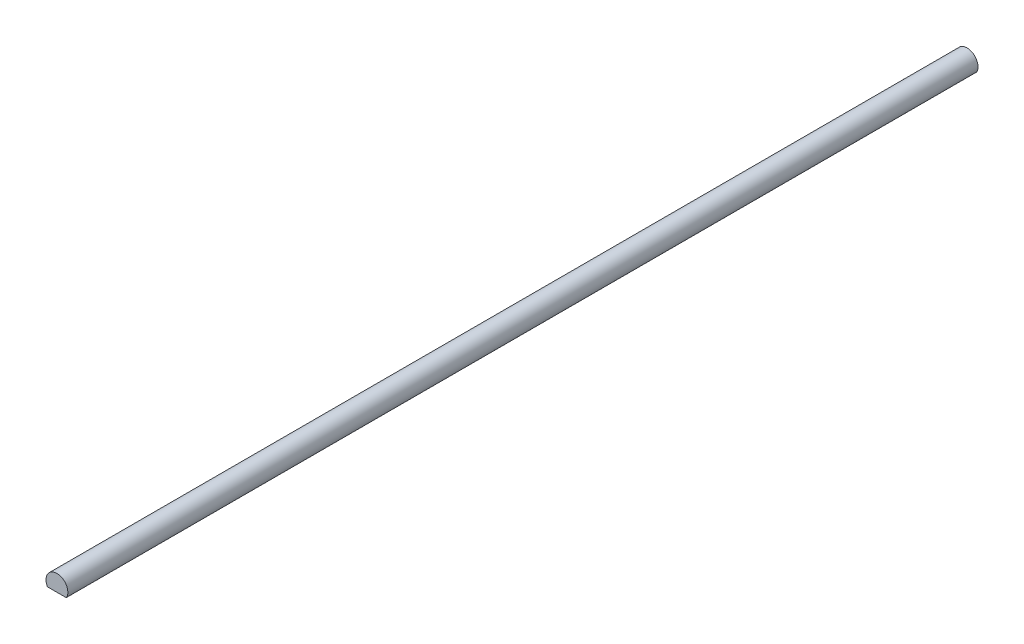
ISO-10303-21;
HEADER;
FILE_DESCRIPTION(('STEP AP214'),'2;1');
FILE_NAME('part.step','',(''),(''),'','','');
FILE_SCHEMA(('AUTOMOTIVE_DESIGN { 1 0 10303 214 1 1 1 1 }'));
ENDSEC;
DATA;
#1=APPLICATION_CONTEXT('core data for automotive mechanical design processes');
#2=APPLICATION_PROTOCOL_DEFINITION('international standard','automotive_design',2000,#1);
#3=PRODUCT_CONTEXT('',#1,'mechanical');
#4=PRODUCT('Part','Part','',(#3));
#5=PRODUCT_RELATED_PRODUCT_CATEGORY('part','',(#4));
#6=PRODUCT_DEFINITION_FORMATION('','',#4);
#7=PRODUCT_DEFINITION_CONTEXT('part definition',#1,'design');
#8=PRODUCT_DEFINITION('design','',#6,#7);
#9=PRODUCT_DEFINITION_SHAPE('','',#8);
#10=(LENGTH_UNIT() NAMED_UNIT(*) SI_UNIT(.MILLI.,.METRE.));
#11=(NAMED_UNIT(*) PLANE_ANGLE_UNIT() SI_UNIT($,.RADIAN.));
#12=(NAMED_UNIT(*) SI_UNIT($,.STERADIAN.) SOLID_ANGLE_UNIT());
#13=UNCERTAINTY_MEASURE_WITH_UNIT(LENGTH_MEASURE(1.E-05),#10,'distance_accuracy_value','');
#14=(GEOMETRIC_REPRESENTATION_CONTEXT(3) GLOBAL_UNCERTAINTY_ASSIGNED_CONTEXT((#13)) GLOBAL_UNIT_ASSIGNED_CONTEXT((#10,
#11,#12)) REPRESENTATION_CONTEXT('',''));
#15=CARTESIAN_POINT('',(0.,0.,0.));
#16=DIRECTION('',(0.,0.,1.));
#17=DIRECTION('',(1.,0.,0.));
#18=AXIS2_PLACEMENT_3D('',#15,#16,#17);
#19=CARTESIAN_POINT('',(4.8989794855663,0.5,500.));
#20=DIRECTION('',(0.,0.,-1.));
#21=DIRECTION('',(-1.,0.,0.));
#22=AXIS2_PLACEMENT_3D('',#19,#20,#21);
#23=CYLINDRICAL_SURFACE('',#22,0.500000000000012);
#24=CARTESIAN_POINT('',(4.8989794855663,0.5,0.));
#25=DIRECTION('',(0.,0.,1.));
#26=DIRECTION('',(1.,0.,0.));
#27=AXIS2_PLACEMENT_3D('',#24,#25,#26);
#28=CIRCLE('',#27,0.500000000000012);
#29=CARTESIAN_POINT('',(4.8989794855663,0.,0.));
#30=VERTEX_POINT('',#29);
#31=CARTESIAN_POINT('',(5.34434125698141,0.272727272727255,0.));
#32=VERTEX_POINT('',#31);
#33=EDGE_CURVE('E77',#30,#32,#28,.T.);
#34=ORIENTED_EDGE('',*,*,#33,.T.);
#35=DIRECTION('',(0.,0.,-1.));
#36=VECTOR('',#35,1.);
#37=CARTESIAN_POINT('',(5.34434125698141,0.272727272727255,500.));
#38=LINE('',#37,#36);
#39=CARTESIAN_POINT('',(5.34434125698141,0.272727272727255,500.));
#40=VERTEX_POINT('',#39);
#41=EDGE_CURVE('E9',#40,#32,#38,.T.);
#42=ORIENTED_EDGE('',*,*,#41,.F.);
#43=CARTESIAN_POINT('',(4.8989794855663,0.5,500.));
#44=DIRECTION('',(0.,0.,1.));
#45=DIRECTION('',(1.,0.,0.));
#46=AXIS2_PLACEMENT_3D('',#43,#44,#45);
#47=CIRCLE('',#46,0.500000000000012);
#48=CARTESIAN_POINT('',(4.8989794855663,0.,500.));
#49=VERTEX_POINT('',#48);
#50=EDGE_CURVE('E65',#49,#40,#47,.T.);
#51=ORIENTED_EDGE('',*,*,#50,.F.);
#52=DIRECTION('',(0.,0.,-1.));
#53=VECTOR('',#52,1.);
#54=CARTESIAN_POINT('',(4.8989794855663,0.,500.));
#55=LINE('',#54,#53);
#56=EDGE_CURVE('E73',#49,#30,#55,.T.);
#57=ORIENTED_EDGE('',*,*,#56,.T.);
#58=EDGE_LOOP('',(#34,#42,#51,#57));
#59=FACE_BOUND('',#58,.T.);
#60=ADVANCED_FACE('F14',(#59),#23,.T.);
#61=CARTESIAN_POINT('',(0.,3.00000000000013,500.));
#62=DIRECTION('',(0.,0.,-1.));
#63=DIRECTION('',(-1.,0.,0.));
#64=AXIS2_PLACEMENT_3D('',#61,#62,#63);
#65=CYLINDRICAL_SURFACE('',#64,6.);
#66=CARTESIAN_POINT('',(0.,3.00000000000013,0.));
#67=DIRECTION('',(0.,0.,1.));
#68=DIRECTION('',(1.,0.,0.));
#69=AXIS2_PLACEMENT_3D('',#66,#67,#68);
#70=CIRCLE('',#69,6.);
#71=CARTESIAN_POINT('',(-5.34434125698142,0.272727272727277,0.));
#72=VERTEX_POINT('',#71);
#73=EDGE_CURVE('E69',#32,#72,#70,.T.);
#74=ORIENTED_EDGE('',*,*,#73,.T.);
#75=DIRECTION('',(0.,0.,-1.));
#76=VECTOR('',#75,1.);
#77=CARTESIAN_POINT('',(-5.34434125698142,0.272727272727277,500.));
#78=LINE('',#77,#76);
#79=CARTESIAN_POINT('',(-5.34434125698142,0.272727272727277,500.));
#80=VERTEX_POINT('',#79);
#81=EDGE_CURVE('E22',#80,#72,#78,.T.);
#82=ORIENTED_EDGE('',*,*,#81,.F.);
#83=CARTESIAN_POINT('',(0.,3.00000000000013,500.));
#84=DIRECTION('',(0.,0.,1.));
#85=DIRECTION('',(1.,0.,0.));
#86=AXIS2_PLACEMENT_3D('',#83,#84,#85);
#87=CIRCLE('',#86,6.);
#88=EDGE_CURVE('E60',#40,#80,#87,.T.);
#89=ORIENTED_EDGE('',*,*,#88,.F.);
#90=ORIENTED_EDGE('',*,*,#41,.T.);
#91=EDGE_LOOP('',(#74,#82,#89,#90));
#92=FACE_BOUND('',#91,.T.);
#93=ADVANCED_FACE('F68',(#92),#65,.T.);
#94=CARTESIAN_POINT('',(-4.8989794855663,0.500000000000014,500.));
#95=DIRECTION('',(0.,0.,-1.));
#96=DIRECTION('',(-1.,0.,0.));
#97=AXIS2_PLACEMENT_3D('',#94,#95,#96);
#98=CYLINDRICAL_SURFACE('',#97,0.500000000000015);
#99=CARTESIAN_POINT('',(-4.8989794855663,0.500000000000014,0.));
#100=DIRECTION('',(0.,0.,1.));
#101=DIRECTION('',(1.,0.,0.));
#102=AXIS2_PLACEMENT_3D('',#99,#100,#101);
#103=CIRCLE('',#102,0.500000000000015);
#104=CARTESIAN_POINT('',(-4.8989794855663,0.,0.));
#105=VERTEX_POINT('',#104);
#106=EDGE_CURVE('E47',#72,#105,#103,.T.);
#107=ORIENTED_EDGE('',*,*,#106,.T.);
#108=DIRECTION('',(0.,0.,-1.));
#109=VECTOR('',#108,1.);
#110=CARTESIAN_POINT('',(-4.8989794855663,0.,500.));
#111=LINE('',#110,#109);
#112=CARTESIAN_POINT('',(-4.8989794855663,0.,500.));
#113=VERTEX_POINT('',#112);
#114=EDGE_CURVE('E70',#113,#105,#111,.T.);
#115=ORIENTED_EDGE('',*,*,#114,.F.);
#116=CARTESIAN_POINT('',(-4.8989794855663,0.500000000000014,500.));
#117=DIRECTION('',(0.,0.,1.));
#118=DIRECTION('',(1.,0.,0.));
#119=AXIS2_PLACEMENT_3D('',#116,#117,#118);
#120=CIRCLE('',#119,0.500000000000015);
#121=EDGE_CURVE('E63',#80,#113,#120,.T.);
#122=ORIENTED_EDGE('',*,*,#121,.F.);
#123=ORIENTED_EDGE('',*,*,#81,.T.);
#124=EDGE_LOOP('',(#107,#115,#122,#123));
#125=FACE_BOUND('',#124,.T.);
#126=ADVANCED_FACE('F71',(#125),#98,.T.);
#127=CARTESIAN_POINT('',(-4.8989794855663,0.,500.));
#128=DIRECTION('',(0.,1.,0.));
#129=DIRECTION('',(-1.,0.,0.));
#130=AXIS2_PLACEMENT_3D('',#127,#128,#129);
#131=PLANE('',#130);
#132=DIRECTION('',(1.,0.,0.));
#133=VECTOR('',#132,1.);
#134=CARTESIAN_POINT('',(-4.8989794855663,0.,0.));
#135=LINE('',#134,#133);
#136=EDGE_CURVE('E53',#105,#30,#135,.T.);
#137=ORIENTED_EDGE('',*,*,#136,.T.);
#138=ORIENTED_EDGE('',*,*,#56,.F.);
#139=DIRECTION('',(1.,0.,0.));
#140=VECTOR('',#139,1.);
#141=CARTESIAN_POINT('',(-4.8989794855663,0.,500.));
#142=LINE('',#141,#140);
#143=EDGE_CURVE('E30',#113,#49,#142,.T.);
#144=ORIENTED_EDGE('',*,*,#143,.F.);
#145=ORIENTED_EDGE('',*,*,#114,.T.);
#146=EDGE_LOOP('',(#137,#138,#144,#145));
#147=FACE_BOUND('',#146,.T.);
#148=ADVANCED_FACE('F84',(#147),#131,.F.);
#149=CARTESIAN_POINT('',(4.8989794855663,0.5,500.));
#150=DIRECTION('',(0.,0.,1.));
#151=DIRECTION('',(1.,0.,0.));
#152=AXIS2_PLACEMENT_3D('',#149,#150,#151);
#153=PLANE('',#152);
#154=ORIENTED_EDGE('',*,*,#50,.T.);
#155=ORIENTED_EDGE('',*,*,#88,.T.);
#156=ORIENTED_EDGE('',*,*,#121,.T.);
#157=ORIENTED_EDGE('',*,*,#143,.T.);
#158=EDGE_LOOP('',(#154,#155,#156,#157));
#159=FACE_BOUND('',#158,.T.);
#160=ADVANCED_FACE('F61',(#159),#153,.T.);
#161=CARTESIAN_POINT('',(4.8989794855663,0.5,0.));
#162=DIRECTION('',(0.,0.,1.));
#163=DIRECTION('',(1.,0.,0.));
#164=AXIS2_PLACEMENT_3D('',#161,#162,#163);
#165=PLANE('',#164);
#166=ORIENTED_EDGE('',*,*,#33,.F.);
#167=ORIENTED_EDGE('',*,*,#136,.F.);
#168=ORIENTED_EDGE('',*,*,#106,.F.);
#169=ORIENTED_EDGE('',*,*,#73,.F.);
#170=EDGE_LOOP('',(#166,#167,#168,#169));
#171=FACE_BOUND('',#170,.T.);
#172=ADVANCED_FACE('F87',(#171),#165,.F.);
#173=CLOSED_SHELL('',(#60,#93,#126,#148,#160,#172));
#174=MANIFOLD_SOLID_BREP('B1',#173);
#175=ADVANCED_BREP_SHAPE_REPRESENTATION('',(#18,#174),#14);
#176=SHAPE_DEFINITION_REPRESENTATION(#9,#175);
ENDSEC;
END-ISO-10303-21;
